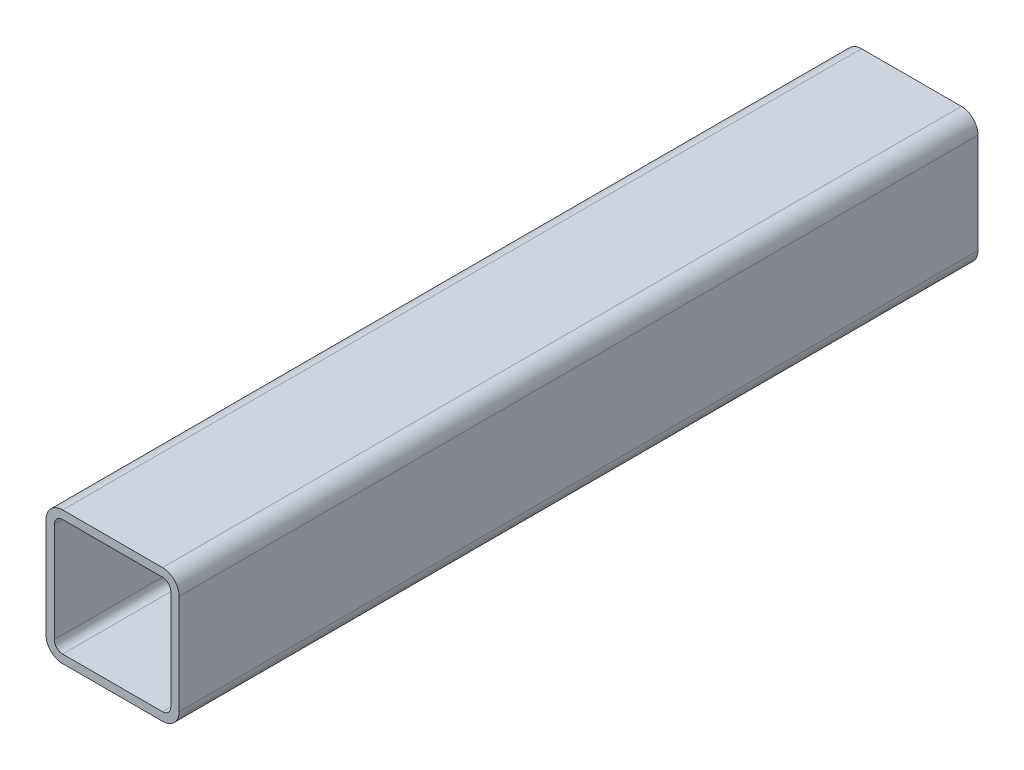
from build123d import *

# Parameters (mm, degrees)
BOSS_EXTRUDE1_DEPTH = 304.8


with BuildPart() as part:
    # Sketch1 → Boss-Extrude1 (new body)
    with BuildSketch(Plane.XY):
        with BuildLine():
            Line((6.35, 50.8), (44.45, 50.8))
            ThreePointArc((44.45, 50.8), (48.940128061, 48.940128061), (50.8, 44.45))
            Line((50.8, 44.45), (50.8, 6.35))
            ThreePointArc((50.8, 6.35), (48.940128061, 1.859871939), (44.45, 0))
            Line((44.45, 0), (6.35, 0))
            ThreePointArc((6.35, 0), (1.859871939, 1.859871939), (0, 6.35))
            Line((0, 6.35), (0, 44.45))
            ThreePointArc((0, 44.45), (1.859871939, 48.940128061), (6.35, 50.8))
        make_face()
        with BuildLine():
            Line((6.35, 47.625), (44.45, 47.625))
            ThreePointArc((44.45, 47.625), (46.69506403, 46.69506403), (47.625, 44.45))
            Line((47.625, 44.45), (47.625, 6.35))
            ThreePointArc((47.625, 6.35), (46.69506403, 4.10493597), (44.45, 3.175))
            Line((44.45, 3.175), (6.35, 3.175))
            ThreePointArc((6.35, 3.175), (4.10493597, 4.10493597), (3.175, 6.35))
            Line((3.175, 6.35), (3.175, 44.45))
            ThreePointArc((3.175, 44.45), (4.10493597, 46.69506403), (6.35, 47.625))
        make_face(mode=Mode.SUBTRACT)
    extrude(amount=BOSS_EXTRUDE1_DEPTH)


solid = part.part
